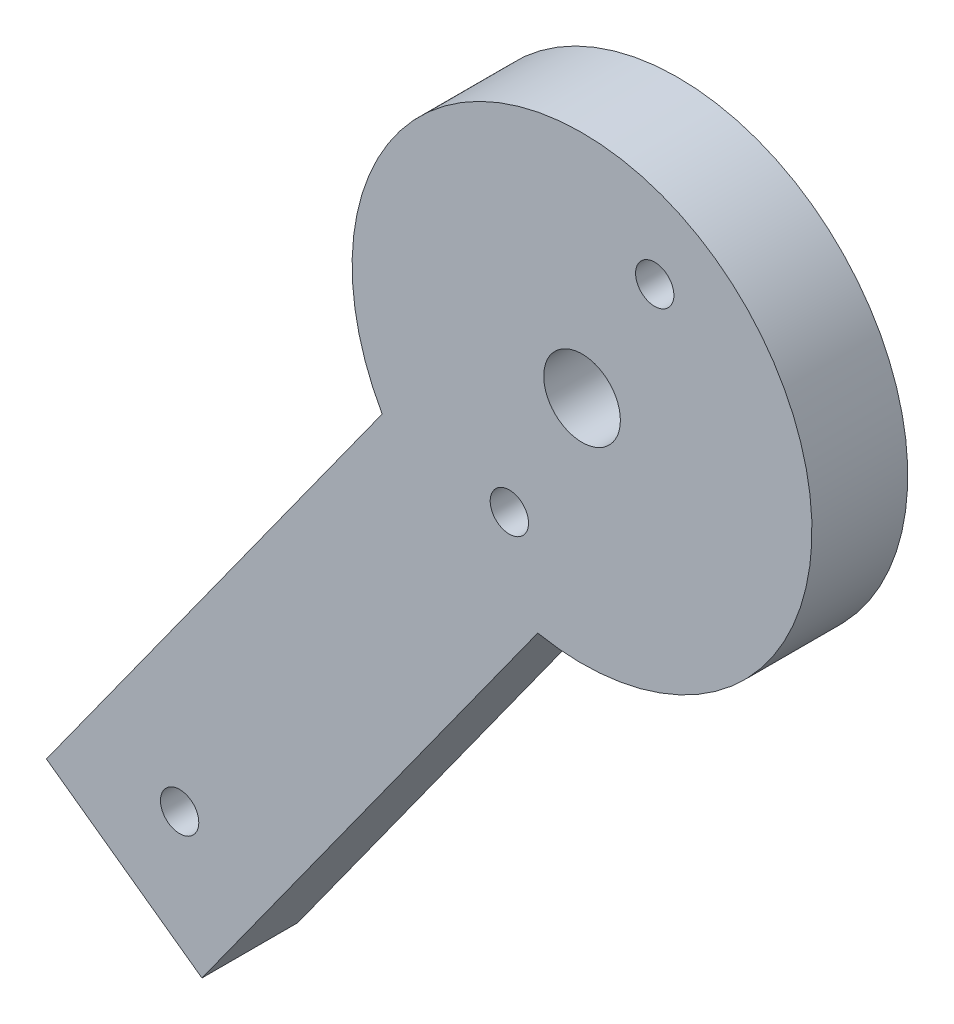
ISO-10303-21;
HEADER;
FILE_DESCRIPTION(('STEP AP214'),'2;1');
FILE_NAME('part.step','',(''),(''),'','','');
FILE_SCHEMA(('AUTOMOTIVE_DESIGN { 1 0 10303 214 1 1 1 1 }'));
ENDSEC;
DATA;
#1=APPLICATION_CONTEXT('core data for automotive mechanical design processes');
#2=APPLICATION_PROTOCOL_DEFINITION('international standard','automotive_design',2000,#1);
#3=PRODUCT_CONTEXT('',#1,'mechanical');
#4=PRODUCT('Part','Part','',(#3));
#5=PRODUCT_RELATED_PRODUCT_CATEGORY('part','',(#4));
#6=PRODUCT_DEFINITION_FORMATION('','',#4);
#7=PRODUCT_DEFINITION_CONTEXT('part definition',#1,'design');
#8=PRODUCT_DEFINITION('design','',#6,#7);
#9=PRODUCT_DEFINITION_SHAPE('','',#8);
#10=(LENGTH_UNIT() NAMED_UNIT(*) SI_UNIT(.MILLI.,.METRE.));
#11=(NAMED_UNIT(*) PLANE_ANGLE_UNIT() SI_UNIT($,.RADIAN.));
#12=(NAMED_UNIT(*) SI_UNIT($,.STERADIAN.) SOLID_ANGLE_UNIT());
#13=UNCERTAINTY_MEASURE_WITH_UNIT(LENGTH_MEASURE(1.E-05),#10,'distance_accuracy_value','');
#14=(GEOMETRIC_REPRESENTATION_CONTEXT(3) GLOBAL_UNCERTAINTY_ASSIGNED_CONTEXT((#13)) GLOBAL_UNIT_ASSIGNED_CONTEXT((#10,
#11,#12)) REPRESENTATION_CONTEXT('',''));
#15=CARTESIAN_POINT('',(0.,0.,0.));
#16=DIRECTION('',(0.,0.,1.));
#17=DIRECTION('',(1.,0.,0.));
#18=AXIS2_PLACEMENT_3D('',#15,#16,#17);
#19=CARTESIAN_POINT('',(0.,0.,5.));
#20=DIRECTION('',(0.,0.,-1.));
#21=DIRECTION('',(-1.,0.,0.));
#22=AXIS2_PLACEMENT_3D('',#19,#20,#21);
#23=CYLINDRICAL_SURFACE('',#22,12.0000031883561);
#24=CARTESIAN_POINT('',(0.,0.,0.));
#25=DIRECTION('',(0.,0.,1.));
#26=DIRECTION('',(1.,0.,0.));
#27=AXIS2_PLACEMENT_3D('',#24,#25,#26);
#28=CIRCLE('',#27,12.0000031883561);
#29=CARTESIAN_POINT('',(-2.31337256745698,-11.7749048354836,0.));
#30=VERTEX_POINT('',#29);
#31=CARTESIAN_POINT('',(-10.4301894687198,-5.93390463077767,0.));
#32=VERTEX_POINT('',#31);
#33=EDGE_CURVE('E95',#30,#32,#28,.T.);
#34=ORIENTED_EDGE('',*,*,#33,.T.);
#35=DIRECTION('',(0.,0.,-1.));
#36=VECTOR('',#35,1.);
#37=CARTESIAN_POINT('',(-10.4301894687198,-5.93390463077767,5.));
#38=LINE('',#37,#36);
#39=CARTESIAN_POINT('',(-10.4301894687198,-5.93390463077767,5.));
#40=VERTEX_POINT('',#39);
#41=EDGE_CURVE('E11',#40,#32,#38,.T.);
#42=ORIENTED_EDGE('',*,*,#41,.F.);
#43=CARTESIAN_POINT('',(0.,0.,5.));
#44=DIRECTION('',(0.,0.,1.));
#45=DIRECTION('',(1.,0.,0.));
#46=AXIS2_PLACEMENT_3D('',#43,#44,#45);
#47=CIRCLE('',#46,12.0000031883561);
#48=CARTESIAN_POINT('',(-2.31337256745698,-11.7749048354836,5.));
#49=VERTEX_POINT('',#48);
#50=EDGE_CURVE('E83',#49,#40,#47,.T.);
#51=ORIENTED_EDGE('',*,*,#50,.F.);
#52=DIRECTION('',(0.,0.,-1.));
#53=VECTOR('',#52,1.);
#54=CARTESIAN_POINT('',(-2.31337256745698,-11.7749048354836,5.));
#55=LINE('',#54,#53);
#56=EDGE_CURVE('E91',#49,#30,#55,.T.);
#57=ORIENTED_EDGE('',*,*,#56,.T.);
#58=EDGE_LOOP('',(#34,#42,#51,#57));
#59=FACE_BOUND('',#58,.T.);
#60=ADVANCED_FACE('F32',(#59),#23,.T.);
#61=CARTESIAN_POINT('',(-10.4301894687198,-5.93390463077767,5.));
#62=DIRECTION('',(0.811681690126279,-0.584100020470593,0.));
#63=DIRECTION('',(0.584100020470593,0.811681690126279,0.));
#64=AXIS2_PLACEMENT_3D('',#61,#62,#63);
#65=PLANE('',#64);
#66=DIRECTION('',(-0.584100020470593,-0.811681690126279,0.));
#67=VECTOR('',#66,1.);
#68=CARTESIAN_POINT('',(-10.4301894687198,-5.93390463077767,0.));
#69=LINE('',#68,#67);
#70=CARTESIAN_POINT('',(-27.9531900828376,-30.2843553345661,0.));
#71=VERTEX_POINT('',#70);
#72=EDGE_CURVE('E87',#32,#71,#69,.T.);
#73=ORIENTED_EDGE('',*,*,#72,.T.);
#74=DIRECTION('',(0.,0.,-1.));
#75=VECTOR('',#74,1.);
#76=CARTESIAN_POINT('',(-27.9531900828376,-30.2843553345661,5.));
#77=LINE('',#76,#75);
#78=CARTESIAN_POINT('',(-27.9531900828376,-30.2843553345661,5.));
#79=VERTEX_POINT('',#78);
#80=EDGE_CURVE('E40',#79,#71,#77,.T.);
#81=ORIENTED_EDGE('',*,*,#80,.F.);
#82=DIRECTION('',(-0.584100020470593,-0.811681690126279,0.));
#83=VECTOR('',#82,1.);
#84=CARTESIAN_POINT('',(-10.4301894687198,-5.93390463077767,5.));
#85=LINE('',#84,#83);
#86=EDGE_CURVE('E78',#40,#79,#85,.T.);
#87=ORIENTED_EDGE('',*,*,#86,.F.);
#88=ORIENTED_EDGE('',*,*,#41,.T.);
#89=EDGE_LOOP('',(#73,#81,#87,#88));
#90=FACE_BOUND('',#89,.T.);
#91=ADVANCED_FACE('F86',(#90),#65,.F.);
#92=CARTESIAN_POINT('',(-27.9531900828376,-30.2843553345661,5.));
#93=DIRECTION('',(0.584100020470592,0.81168169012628,0.));
#94=DIRECTION('',(-0.81168169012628,0.584100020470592,0.));
#95=AXIS2_PLACEMENT_3D('',#92,#93,#94);
#96=PLANE('',#95);
#97=DIRECTION('',(0.81168169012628,-0.584100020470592,0.));
#98=VECTOR('',#97,1.);
#99=CARTESIAN_POINT('',(-27.9531900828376,-30.2843553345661,0.));
#100=LINE('',#99,#98);
#101=CARTESIAN_POINT('',(-19.8363731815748,-36.125355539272,0.));
#102=VERTEX_POINT('',#101);
#103=EDGE_CURVE('E65',#71,#102,#100,.T.);
#104=ORIENTED_EDGE('',*,*,#103,.T.);
#105=DIRECTION('',(0.,0.,-1.));
#106=VECTOR('',#105,1.);
#107=CARTESIAN_POINT('',(-19.8363731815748,-36.125355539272,5.));
#108=LINE('',#107,#106);
#109=CARTESIAN_POINT('',(-19.8363731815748,-36.125355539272,5.));
#110=VERTEX_POINT('',#109);
#111=EDGE_CURVE('E88',#110,#102,#108,.T.);
#112=ORIENTED_EDGE('',*,*,#111,.F.);
#113=DIRECTION('',(0.81168169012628,-0.584100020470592,0.));
#114=VECTOR('',#113,1.);
#115=CARTESIAN_POINT('',(-27.9531900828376,-30.2843553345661,5.));
#116=LINE('',#115,#114);
#117=EDGE_CURVE('E81',#79,#110,#116,.T.);
#118=ORIENTED_EDGE('',*,*,#117,.F.);
#119=ORIENTED_EDGE('',*,*,#80,.T.);
#120=EDGE_LOOP('',(#104,#112,#118,#119));
#121=FACE_BOUND('',#120,.T.);
#122=ADVANCED_FACE('F89',(#121),#96,.F.);
#123=CARTESIAN_POINT('',(-2.31337256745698,-11.7749048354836,5.));
#124=DIRECTION('',(-0.811681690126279,0.584100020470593,0.));
#125=DIRECTION('',(-0.584100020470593,-0.811681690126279,0.));
#126=AXIS2_PLACEMENT_3D('',#123,#124,#125);
#127=PLANE('',#126);
#128=DIRECTION('',(0.584100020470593,0.811681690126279,0.));
#129=VECTOR('',#128,1.);
#130=CARTESIAN_POINT('',(-2.31337256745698,-11.7749048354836,0.));
#131=LINE('',#130,#129);
#132=EDGE_CURVE('E71',#102,#30,#131,.T.);
#133=ORIENTED_EDGE('',*,*,#132,.T.);
#134=ORIENTED_EDGE('',*,*,#56,.F.);
#135=DIRECTION('',(0.584100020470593,0.811681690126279,0.));
#136=VECTOR('',#135,1.);
#137=CARTESIAN_POINT('',(-2.31337256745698,-11.7749048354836,5.));
#138=LINE('',#137,#136);
#139=EDGE_CURVE('E48',#110,#49,#138,.T.);
#140=ORIENTED_EDGE('',*,*,#139,.F.);
#141=ORIENTED_EDGE('',*,*,#111,.T.);
#142=EDGE_LOOP('',(#133,#134,#140,#141));
#143=FACE_BOUND('',#142,.T.);
#144=ADVANCED_FACE('F103',(#143),#127,.F.);
#145=CARTESIAN_POINT('',(0.,0.,5.));
#146=DIRECTION('',(0.,0.,1.));
#147=DIRECTION('',(1.,0.,0.));
#148=AXIS2_PLACEMENT_3D('',#145,#146,#147);
#149=PLANE('',#148);
#150=CARTESIAN_POINT('',(-3.79297613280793,-7.04367319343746,5.));
#151=DIRECTION('',(0.,0.,1.));
#152=DIRECTION('',(1.,0.,0.));
#153=AXIS2_PLACEMENT_3D('',#150,#151,#152);
#154=CIRCLE('',#153,1.);
#155=CARTESIAN_POINT('',(-2.79297613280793,-7.04367319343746,5.));
#156=VERTEX_POINT('',#155);
#157=EDGE_CURVE('E127',#156,#156,#154,.T.);
#158=ORIENTED_EDGE('',*,*,#157,.F.);
#159=EDGE_LOOP('',(#158));
#160=FACE_BOUND('',#159,.T.);
#161=CARTESIAN_POINT('',(3.79297613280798,7.04367319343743,5.));
#162=DIRECTION('',(0.,0.,1.));
#163=DIRECTION('',(1.,0.,0.));
#164=AXIS2_PLACEMENT_3D('',#161,#162,#163);
#165=CIRCLE('',#164,1.);
#166=CARTESIAN_POINT('',(4.79297613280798,7.04367319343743,5.));
#167=VERTEX_POINT('',#166);
#168=EDGE_CURVE('E121',#167,#167,#165,.T.);
#169=ORIENTED_EDGE('',*,*,#168,.F.);
#170=EDGE_LOOP('',(#169));
#171=FACE_BOUND('',#170,.T.);
#172=CARTESIAN_POINT('',(-21.0015498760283,-29.1843398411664,5.));
#173=DIRECTION('',(0.,0.,1.));
#174=DIRECTION('',(1.,0.,0.));
#175=AXIS2_PLACEMENT_3D('',#172,#173,#174);
#176=CIRCLE('',#175,1.);
#177=CARTESIAN_POINT('',(-20.0015498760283,-29.1843398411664,5.));
#178=VERTEX_POINT('',#177);
#179=EDGE_CURVE('E115',#178,#178,#176,.T.);
#180=ORIENTED_EDGE('',*,*,#179,.F.);
#181=EDGE_LOOP('',(#180));
#182=FACE_BOUND('',#181,.T.);
#183=CARTESIAN_POINT('',(0.,0.,5.));
#184=DIRECTION('',(0.,0.,1.));
#185=DIRECTION('',(1.,0.,0.));
#186=AXIS2_PLACEMENT_3D('',#183,#184,#185);
#187=CIRCLE('',#186,2.);
#188=CARTESIAN_POINT('',(2.,0.,5.));
#189=VERTEX_POINT('',#188);
#190=EDGE_CURVE('E109',#189,#189,#187,.T.);
#191=ORIENTED_EDGE('',*,*,#190,.F.);
#192=EDGE_LOOP('',(#191));
#193=FACE_BOUND('',#192,.T.);
#194=ORIENTED_EDGE('',*,*,#50,.T.);
#195=ORIENTED_EDGE('',*,*,#86,.T.);
#196=ORIENTED_EDGE('',*,*,#117,.T.);
#197=ORIENTED_EDGE('',*,*,#139,.T.);
#198=EDGE_LOOP('',(#194,#195,#196,#197));
#199=FACE_BOUND('',#198,.T.);
#200=ADVANCED_FACE('F79',(#160,#171,#182,#193,#199),#149,.T.);
#201=CARTESIAN_POINT('',(0.,0.,0.));
#202=DIRECTION('',(0.,0.,1.));
#203=DIRECTION('',(1.,0.,0.));
#204=AXIS2_PLACEMENT_3D('',#201,#202,#203);
#205=PLANE('',#204);
#206=CARTESIAN_POINT('',(-3.79297613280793,-7.04367319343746,0.));
#207=DIRECTION('',(0.,0.,1.));
#208=DIRECTION('',(1.,0.,0.));
#209=AXIS2_PLACEMENT_3D('',#206,#207,#208);
#210=CIRCLE('',#209,1.);
#211=CARTESIAN_POINT('',(-2.79297613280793,-7.04367319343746,0.));
#212=VERTEX_POINT('',#211);
#213=EDGE_CURVE('E124',#212,#212,#210,.T.);
#214=ORIENTED_EDGE('',*,*,#213,.T.);
#215=EDGE_LOOP('',(#214));
#216=FACE_BOUND('',#215,.T.);
#217=CARTESIAN_POINT('',(3.79297613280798,7.04367319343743,0.));
#218=DIRECTION('',(0.,0.,1.));
#219=DIRECTION('',(1.,0.,0.));
#220=AXIS2_PLACEMENT_3D('',#217,#218,#219);
#221=CIRCLE('',#220,1.);
#222=CARTESIAN_POINT('',(4.79297613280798,7.04367319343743,0.));
#223=VERTEX_POINT('',#222);
#224=EDGE_CURVE('E118',#223,#223,#221,.T.);
#225=ORIENTED_EDGE('',*,*,#224,.T.);
#226=EDGE_LOOP('',(#225));
#227=FACE_BOUND('',#226,.T.);
#228=CARTESIAN_POINT('',(-21.0015498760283,-29.1843398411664,0.));
#229=DIRECTION('',(0.,0.,1.));
#230=DIRECTION('',(1.,0.,0.));
#231=AXIS2_PLACEMENT_3D('',#228,#229,#230);
#232=CIRCLE('',#231,1.);
#233=CARTESIAN_POINT('',(-20.0015498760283,-29.1843398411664,0.));
#234=VERTEX_POINT('',#233);
#235=EDGE_CURVE('E112',#234,#234,#232,.T.);
#236=ORIENTED_EDGE('',*,*,#235,.T.);
#237=EDGE_LOOP('',(#236));
#238=FACE_BOUND('',#237,.T.);
#239=CARTESIAN_POINT('',(0.,0.,0.));
#240=DIRECTION('',(0.,0.,1.));
#241=DIRECTION('',(1.,0.,0.));
#242=AXIS2_PLACEMENT_3D('',#239,#240,#241);
#243=CIRCLE('',#242,2.);
#244=CARTESIAN_POINT('',(2.,0.,0.));
#245=VERTEX_POINT('',#244);
#246=EDGE_CURVE('E98',#245,#245,#243,.T.);
#247=ORIENTED_EDGE('',*,*,#246,.T.);
#248=EDGE_LOOP('',(#247));
#249=FACE_BOUND('',#248,.T.);
#250=ORIENTED_EDGE('',*,*,#33,.F.);
#251=ORIENTED_EDGE('',*,*,#132,.F.);
#252=ORIENTED_EDGE('',*,*,#103,.F.);
#253=ORIENTED_EDGE('',*,*,#72,.F.);
#254=EDGE_LOOP('',(#250,#251,#252,#253));
#255=FACE_BOUND('',#254,.T.);
#256=ADVANCED_FACE('F106',(#216,#227,#238,#249,#255),#205,.F.);
#257=CARTESIAN_POINT('',(0.,0.,0.));
#258=DIRECTION('',(0.,0.,1.));
#259=DIRECTION('',(1.,0.,0.));
#260=AXIS2_PLACEMENT_3D('',#257,#258,#259);
#261=CYLINDRICAL_SURFACE('',#260,2.);
#262=ORIENTED_EDGE('',*,*,#246,.F.);
#263=EDGE_LOOP('',(#262));
#264=FACE_BOUND('',#263,.T.);
#265=ORIENTED_EDGE('',*,*,#190,.T.);
#266=EDGE_LOOP('',(#265));
#267=FACE_BOUND('',#266,.T.);
#268=ADVANCED_FACE('F151',(#264,#267),#261,.F.);
#269=CARTESIAN_POINT('',(-21.0015498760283,-29.1843398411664,0.));
#270=DIRECTION('',(0.,0.,1.));
#271=DIRECTION('',(1.,0.,0.));
#272=AXIS2_PLACEMENT_3D('',#269,#270,#271);
#273=CYLINDRICAL_SURFACE('',#272,1.);
#274=ORIENTED_EDGE('',*,*,#235,.F.);
#275=EDGE_LOOP('',(#274));
#276=FACE_BOUND('',#275,.T.);
#277=ORIENTED_EDGE('',*,*,#179,.T.);
#278=EDGE_LOOP('',(#277));
#279=FACE_BOUND('',#278,.T.);
#280=ADVANCED_FACE('F153',(#276,#279),#273,.F.);
#281=CARTESIAN_POINT('',(3.79297613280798,7.04367319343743,0.));
#282=DIRECTION('',(0.,0.,1.));
#283=DIRECTION('',(1.,0.,0.));
#284=AXIS2_PLACEMENT_3D('',#281,#282,#283);
#285=CYLINDRICAL_SURFACE('',#284,1.);
#286=ORIENTED_EDGE('',*,*,#224,.F.);
#287=EDGE_LOOP('',(#286));
#288=FACE_BOUND('',#287,.T.);
#289=ORIENTED_EDGE('',*,*,#168,.T.);
#290=EDGE_LOOP('',(#289));
#291=FACE_BOUND('',#290,.T.);
#292=ADVANCED_FACE('F138',(#288,#291),#285,.F.);
#293=CARTESIAN_POINT('',(-3.79297613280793,-7.04367319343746,0.));
#294=DIRECTION('',(0.,0.,1.));
#295=DIRECTION('',(1.,0.,0.));
#296=AXIS2_PLACEMENT_3D('',#293,#294,#295);
#297=CYLINDRICAL_SURFACE('',#296,1.);
#298=ORIENTED_EDGE('',*,*,#213,.F.);
#299=EDGE_LOOP('',(#298));
#300=FACE_BOUND('',#299,.T.);
#301=ORIENTED_EDGE('',*,*,#157,.T.);
#302=EDGE_LOOP('',(#301));
#303=FACE_BOUND('',#302,.T.);
#304=ADVANCED_FACE('F135',(#300,#303),#297,.F.);
#305=CLOSED_SHELL('',(#60,#91,#122,#144,#200,#256,#268,#280,#292,#304));
#306=MANIFOLD_SOLID_BREP('B2',#305);
#307=ADVANCED_BREP_SHAPE_REPRESENTATION('',(#18,#306),#14);
#308=SHAPE_DEFINITION_REPRESENTATION(#9,#307);
ENDSEC;
END-ISO-10303-21;
